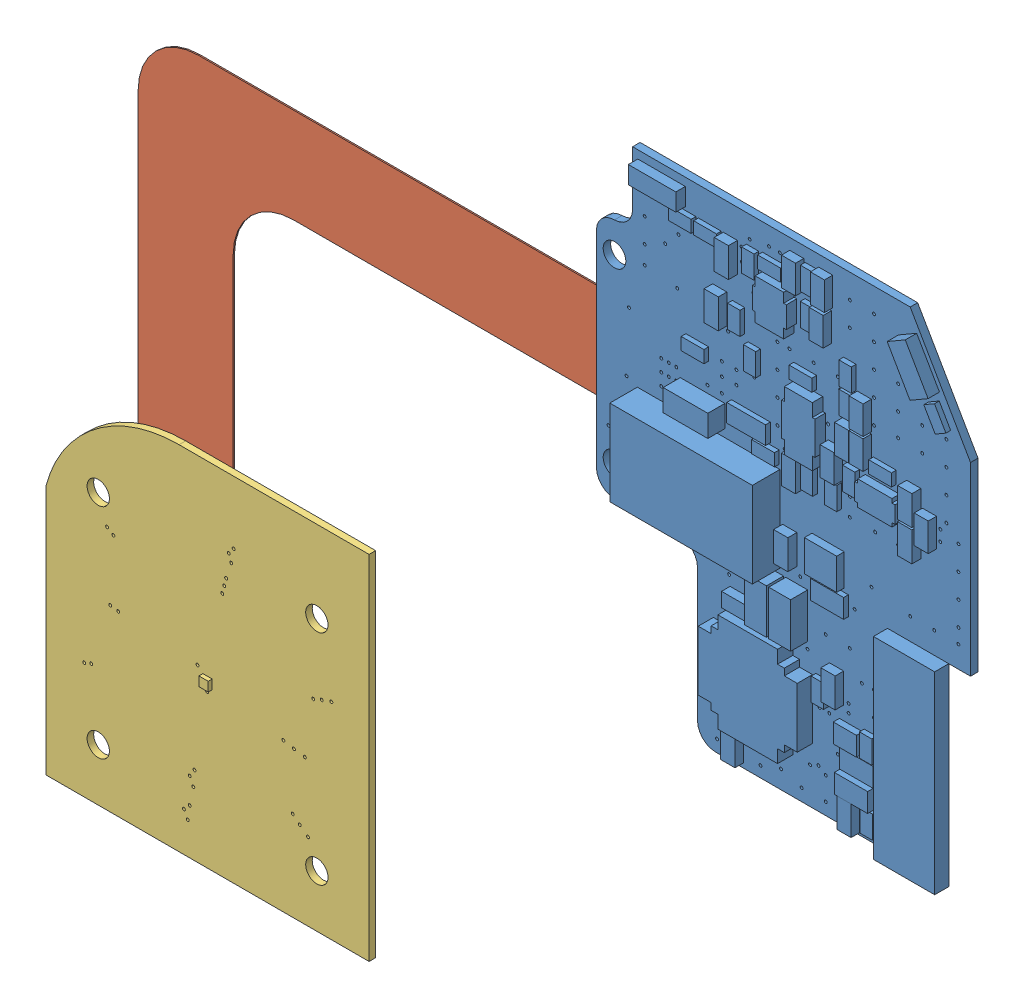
SolidWorks assembly 010900_LnG_heater.SLDASM, configuration Default (file format 12000). Lengths in mm.
Overall size (139.5 99.6 14.01).
3 component instances, 3 part files, 3 mates.
Components (placement in the parent):
- 100221165rC_SolidModel_wFlexPads-1: 100221165rC_SolidModel_wFlexPads.SLDPRT [Default] at (62.72 -3.8 -0.7874) x (0 -1 0) z (0 0 1) size (50.8 39.37 4.74)
- heater_flex-1: heater_flex.SLDPRT [Default] at origin size (139.5 99.6 14.01)
- 100221166rE_3g_puckheater_091222-1: 100221166rE_3g_puckheater_091222.SLDPRT [Default] at (17.9004 -75.0085 -0.0908) x (-1 0 0) z (0 0 -1) size (34 37.1 1.14)
Mates (geometry in assembly coordinates):
- Coincident1: coincident: plane of heater_flex-1 through (33.5062 -90.0207 -0.8096) normal (0 0 1); plane of 100221166rE_3g_puckheater_091222-1 through (17.9004 -75.0085 -0.8096) normal (0 0 -1)
- Symmetric1: symmetric: plane of assembly; plane of assembly; plane of heater_flex-1 through (9.8778 -61.0106 -0.9496) normal (0 -1 0); plane of 100221166rE_3g_puckheater_091222-1 through (19.752 -59.9362 -0.8096) normal (0 1 0); plane of 100221166rE_3g_puckheater_091222-1 through (18.7513 -62.085 -0.8096) normal (0 -1 0)
- Width1: width anti-aligned: plane of heater_flex-1 through (19.8778 -29.12 -0.9496) normal (1 0 0); plane of 100221166rE_3g_puckheater_091222-1 through (9.8778 -19.12 -0.9496) normal (-1 0 0); plane of heater_flex-1 through (8.9037 -57.1904 -0.8096) normal (-1 0 0); plane of 100221166rE_3g_puckheater_091222-1 through (20.8519 -59.5323 -0.8096) normal (1 0 0)
